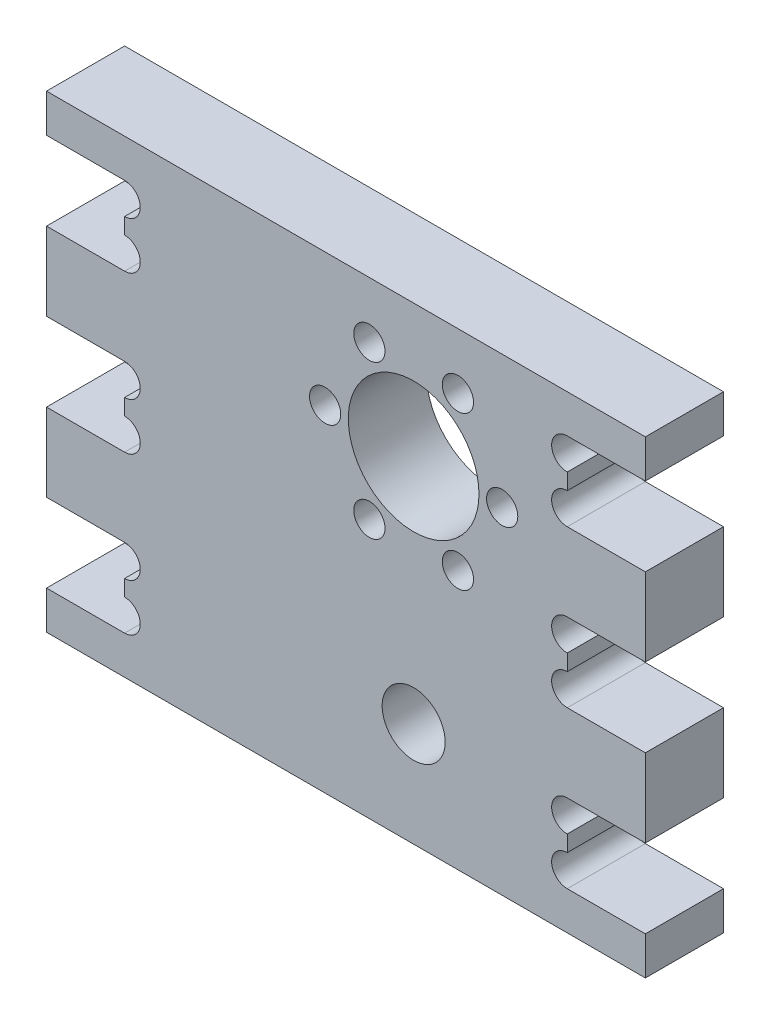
from build123d import *

# Parameters (mm, degrees)
OUTLINE_DEPTH = 15
SKIZZE2_R     = 12.55
SKIZZE2_R_2   = 6.05
INNER_DEPTH   = 15
SKIZZE3_R     = 3
HOLES_DEPTH   = 20


with BuildPart() as part:
    # Skizze1 → outline (new body)
    with BuildSketch(Plane.XY):
        with BuildLine():
            Line((15, 82.65), (0, 82.65))
            Line((0, 82.65), (0, 90))
            Line((0, 90), (115, 90))
            Line((115, 90), (115, 82.65))
            Line((115, 82.65), (100, 82.65))
            ThreePointArc((100, 82.65), (97, 79.65), (100, 76.65))
            Line((100, 76.65), (100, 73.55))
            ThreePointArc((100, 73.55), (97, 70.55), (100, 67.55))
            Line((100, 67.55), (115, 67.55))
            Line((115, 67.55), (115, 52.55))
            Line((115, 52.55), (100, 52.55))
            ThreePointArc((100, 52.55), (97, 49.55), (100, 46.55))
            Line((100, 46.55), (100, 43.45))
            ThreePointArc((100, 43.45), (97, 40.45), (100, 37.45))
            Line((100, 37.45), (115, 37.45))
            Line((115, 37.45), (115, 22.45))
            Line((115, 22.45), (100, 22.45))
            ThreePointArc((100, 22.45), (97, 19.45), (100, 16.45))
            Line((100, 16.45), (100, 13.35))
            ThreePointArc((100, 13.35), (97, 10.35), (100, 7.35))
            Line((100, 7.35), (115, 7.35))
            Line((115, 7.35), (115, 0))
            Line((115, 0), (0, 0))
            Line((0, 0), (0, 7.35))
            Line((0, 7.35), (15, 7.35))
            ThreePointArc((15, 7.35), (18, 10.35), (15, 13.35))
            Line((15, 13.35), (15, 16.45))
            ThreePointArc((15, 16.45), (18, 19.45), (15, 22.45))
            Line((15, 22.45), (0, 22.45))
            Line((0, 22.45), (0, 37.45))
            Line((0, 37.45), (15, 37.45))
            ThreePointArc((15, 37.45), (18, 40.45), (15, 43.45))
            Line((15, 43.45), (15, 46.55))
            ThreePointArc((15, 46.55), (18, 49.55), (15, 52.55))
            Line((15, 52.55), (0, 52.55))
            Line((0, 52.55), (0, 67.55))
            Line((0, 67.55), (15, 67.55))
            ThreePointArc((15, 67.55), (18, 70.55), (15, 73.55))
            Line((15, 73.55), (15, 76.65))
            ThreePointArc((15, 76.65), (18, 79.65), (15, 82.65))
        make_face()
    extrude(amount=OUTLINE_DEPTH)

    # Skizze2 → inner (cut)
    with BuildSketch(Plane.XY.offset(15)):
        with Locations((70.5, 64.5)):
            Circle(SKIZZE2_R)
        with Locations((70.5, 20)):
            Circle(SKIZZE2_R_2)
    extrude(amount=-INNER_DEPTH, mode=Mode.SUBTRACT)

    # Skizze3 → holes (cut)
    with BuildSketch(Plane(origin=(0, 0, 0), x_dir=(-1, 0, 0), z_dir=(0, 0, -1))):
        with Locations((-79, 79.222431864)):
            Circle(SKIZZE3_R)
        with Locations((-62, 79.222431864)):
            Circle(SKIZZE3_R)
        with Locations((-53.5, 64.5)):
            Circle(SKIZZE3_R)
        with Locations((-62, 49.777568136)):
            Circle(SKIZZE3_R)
        with Locations((-79, 49.777568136)):
            Circle(SKIZZE3_R)
        with Locations((-87.5, 64.5)):
            Circle(SKIZZE3_R)
    extrude(amount=-HOLES_DEPTH, mode=Mode.SUBTRACT)


solid = part.part
